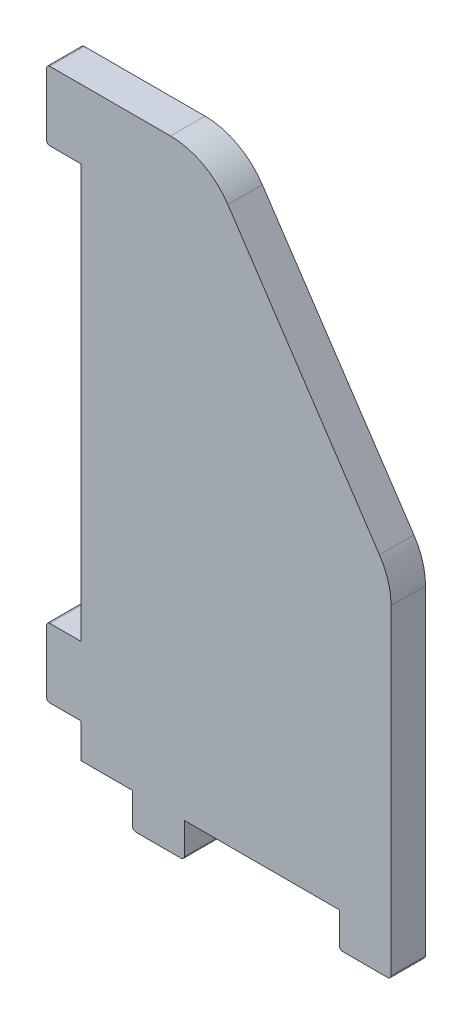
from build123d import *

# Parameters (mm, degrees)
BOSS_EXTRUDE1_DEPTH = 20
FILLET2_R           = 40
FILLET3_R           = 2


with BuildPart() as part:
    # Sketch1 → Boss-Extrude1 (new body)
    with BuildSketch(Plane.XY):
        Polygon((0, 0), (30, 0), (30, -20), (60, -20), (60, 0), (150, 0), (150, -20), (180, -20), (180, 0), (180, 180), (73.383607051, 340), (0, 340), (-20, 340), (-20, 300), (0, 300), (0, 60), (-20, 60), (-20, 20), (0, 20), align=None)
    extrude(amount=BOSS_EXTRUDE1_DEPTH)

    # Fillet2
    fillet2_edges = [part.edges().sort_by_distance(p)[0] for p in [
        (73.383607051, 340, 10),
        (180, 180, 10),
    ]]
    fillet(fillet2_edges, radius=FILLET2_R)

    # Fillet3
    fillet3_edges = [part.edges().sort_by_distance(p)[0] for p in [
        (-20, 20, 10),
        (-20, 60, 10),
        (-20, 300, 10),
        (-20, 340, 10),
        (180, -20, 10),
        (150, -20, 10),
        (60, -20, 10),
        (30, -20, 10),
    ]]
    fillet(fillet3_edges, radius=FILLET3_R)


solid = part.part
